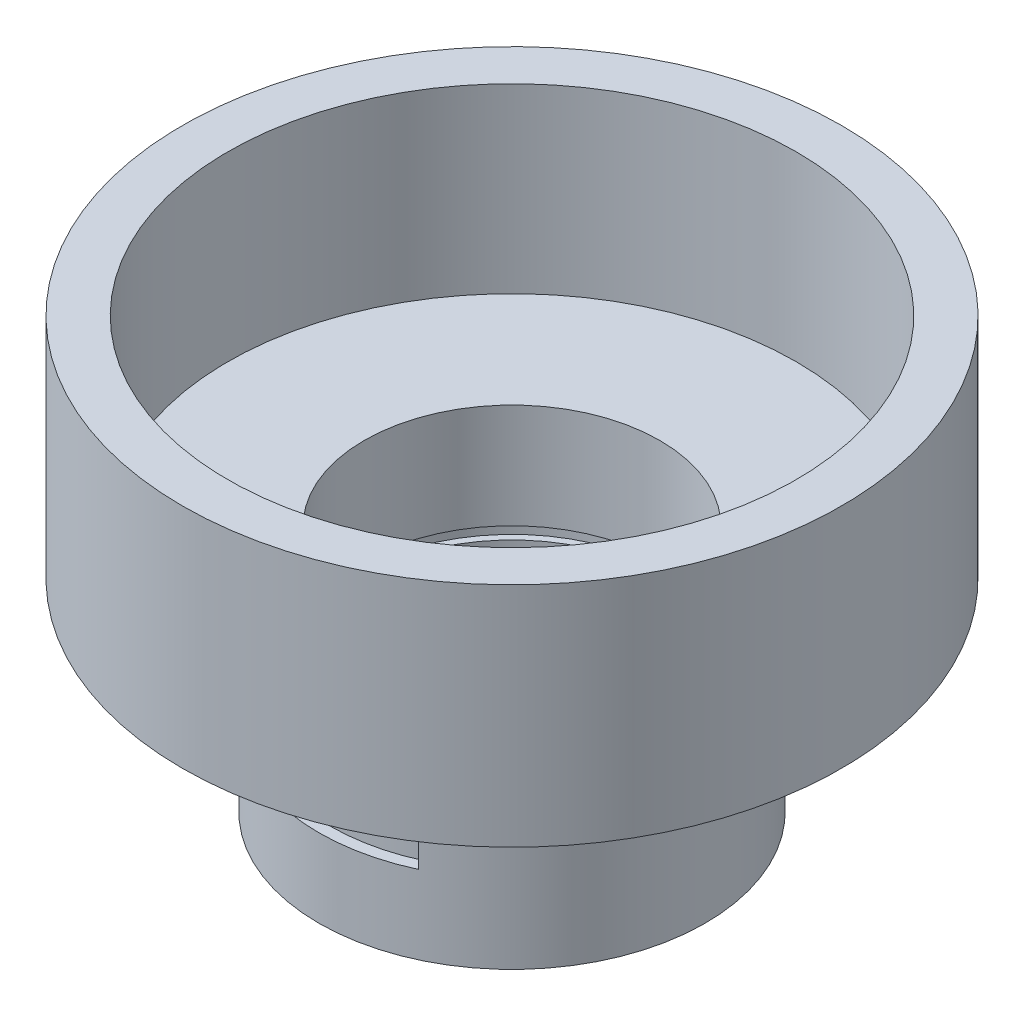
from build123d import *

# Parameters (mm, degrees)
ESQUISSE3_W                  = 10
ESQUISSE3_H                  = 5
ENL_V_MAT_EXTRU_3_DEPTH      = 44.5
ENL_V_MAT_EXTRU_4_DEPTH      = 5
ENL_V_MAT_EXTRU_4_DEPTH_BACK = 5


with BuildPart() as part:
    # Esquisse2 → R_volution1 (revolve)
    with BuildSketch(Plane.XY, mode=Mode.PRIVATE) as r_volution1_sk:
        Polygon((62.5, 75.182682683), (62.5, 35.182682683), (32.5, 35.182682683), (32.5, 12.182682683), (34, 12.182682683), (34, 9.482682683), (32.5, 9.482682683), (32.5, -19.317317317), (42.5, -19.317317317), (42.5, 25.182682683), (72.5, 25.182682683), (72.5, 75.182682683), align=None)
    revolve(r_volution1_sk.sketch.rotate(Axis((0, -55, 0), (0, 1, 0)), 90), axis=Axis((0, -55, 0), (0, 1, 0)))

    # Esquisse3 → Enl_v. mat.-Extru.3 (cut)
    with BuildSketch(Plane.XZ.offset(19.317317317)):
        with Locations((0, -40)):
            Rectangle(ESQUISSE3_W, ESQUISSE3_H)
    extrude(amount=-ENL_V_MAT_EXTRU_3_DEPTH, mode=Mode.SUBTRACT)

    # Esquisse4 → Enl_v. mat.-Extru.4 (cut, two sides: drawn at the far end of the back side and taken through both)
    with BuildSketch(Plane.XZ.offset(-2.932682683).offset(-ENL_V_MAT_EXTRU_4_DEPTH_BACK)):
        with BuildLine():
            Line((-17.961276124, 38.518080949), (-16.90473047, 36.252311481))
            ThreePointArc((-16.90473047, 36.252311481), (0, 40), (16.90473047, 36.252311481))
            Line((16.90473047, 36.252311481), (17.961276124, 38.518080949))
            ThreePointArc((17.961276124, 38.518080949), (0, 42.5), (-17.961276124, 38.518080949))
        make_face()
    extrude(amount=ENL_V_MAT_EXTRU_4_DEPTH + ENL_V_MAT_EXTRU_4_DEPTH_BACK, mode=Mode.SUBTRACT)


solid = part.part
